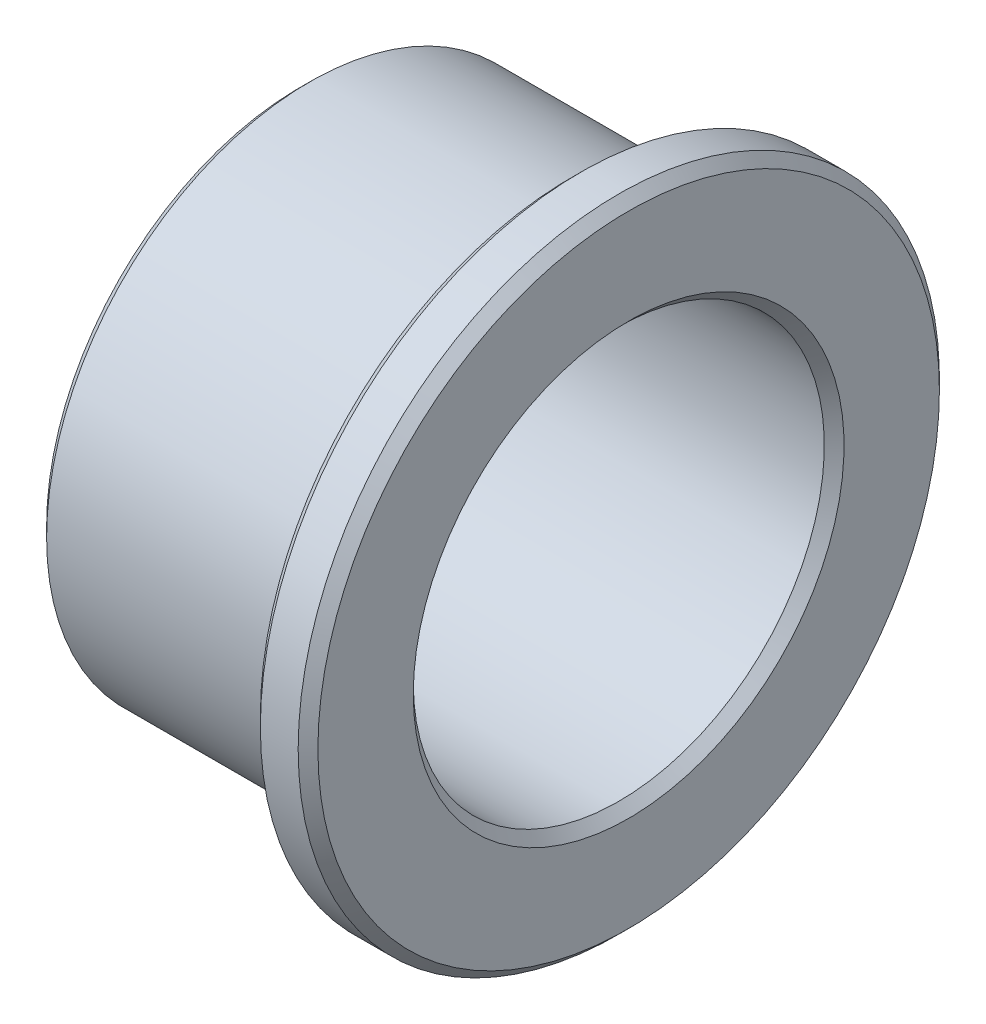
ISO-10303-21;
HEADER;
FILE_DESCRIPTION(('STEP AP214'),'2;1');
FILE_NAME('part.step','',(''),(''),'','','');
FILE_SCHEMA(('AUTOMOTIVE_DESIGN { 1 0 10303 214 1 1 1 1 }'));
ENDSEC;
DATA;
#1=APPLICATION_CONTEXT('core data for automotive mechanical design processes');
#2=APPLICATION_PROTOCOL_DEFINITION('international standard','automotive_design',2000,#1);
#3=PRODUCT_CONTEXT('',#1,'mechanical');
#4=PRODUCT('Part','Part','',(#3));
#5=PRODUCT_RELATED_PRODUCT_CATEGORY('part','',(#4));
#6=PRODUCT_DEFINITION_FORMATION('','',#4);
#7=PRODUCT_DEFINITION_CONTEXT('part definition',#1,'design');
#8=PRODUCT_DEFINITION('design','',#6,#7);
#9=PRODUCT_DEFINITION_SHAPE('','',#8);
#10=(LENGTH_UNIT() NAMED_UNIT(*) SI_UNIT(.MILLI.,.METRE.));
#11=(NAMED_UNIT(*) PLANE_ANGLE_UNIT() SI_UNIT($,.RADIAN.));
#12=(NAMED_UNIT(*) SI_UNIT($,.STERADIAN.) SOLID_ANGLE_UNIT());
#13=UNCERTAINTY_MEASURE_WITH_UNIT(LENGTH_MEASURE(1.E-05),#10,'distance_accuracy_value','');
#14=(GEOMETRIC_REPRESENTATION_CONTEXT(3) GLOBAL_UNCERTAINTY_ASSIGNED_CONTEXT((#13)) GLOBAL_UNIT_ASSIGNED_CONTEXT((#10,
#11,#12)) REPRESENTATION_CONTEXT('',''));
#15=CARTESIAN_POINT('',(0.,0.,0.));
#16=DIRECTION('',(0.,0.,1.));
#17=DIRECTION('',(1.,0.,0.));
#18=AXIS2_PLACEMENT_3D('',#15,#16,#17);
#19=CARTESIAN_POINT('',(0.,0.,0.));
#20=DIRECTION('',(-1.,0.,0.));
#21=DIRECTION('',(0.,0.,1.));
#22=AXIS2_PLACEMENT_3D('',#19,#20,#21);
#23=CONICAL_SURFACE('',#22,13.1,0.785398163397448);
#24=CARTESIAN_POINT('',(0.600000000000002,0.,0.));
#25=DIRECTION('',(-1.,0.,0.));
#26=DIRECTION('',(0.,0.,1.));
#27=AXIS2_PLACEMENT_3D('',#24,#25,#26);
#28=CIRCLE('',#27,12.5);
#29=CARTESIAN_POINT('',(0.600000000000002,0.,12.5));
#30=VERTEX_POINT('',#29);
#31=EDGE_CURVE('E70',#30,#30,#28,.T.);
#32=ORIENTED_EDGE('',*,*,#31,.F.);
#33=EDGE_LOOP('',(#32));
#34=FACE_BOUND('',#33,.T.);
#35=CARTESIAN_POINT('',(0.,0.,0.));
#36=DIRECTION('',(-1.,0.,0.));
#37=DIRECTION('',(0.,0.,1.));
#38=AXIS2_PLACEMENT_3D('',#35,#36,#37);
#39=CIRCLE('',#38,13.1);
#40=CARTESIAN_POINT('',(0.,0.,13.1));
#41=VERTEX_POINT('',#40);
#42=EDGE_CURVE('E10',#41,#41,#39,.T.);
#43=ORIENTED_EDGE('',*,*,#42,.T.);
#44=EDGE_LOOP('',(#43));
#45=FACE_BOUND('',#44,.T.);
#46=ADVANCED_FACE('F30',(#34,#45),#23,.F.);
#47=CARTESIAN_POINT('',(0.,13.1,0.));
#48=DIRECTION('',(1.,0.,0.));
#49=DIRECTION('',(0.,0.,-1.));
#50=AXIS2_PLACEMENT_3D('',#47,#48,#49);
#51=PLANE('',#50);
#52=ORIENTED_EDGE('',*,*,#42,.F.);
#53=EDGE_LOOP('',(#52));
#54=FACE_BOUND('',#53,.T.);
#55=CARTESIAN_POINT('',(0.,0.,0.));
#56=DIRECTION('',(-1.,0.,0.));
#57=DIRECTION('',(0.,0.,1.));
#58=AXIS2_PLACEMENT_3D('',#55,#56,#57);
#59=CIRCLE('',#58,15.4);
#60=CARTESIAN_POINT('',(0.,0.,15.4));
#61=VERTEX_POINT('',#60);
#62=EDGE_CURVE('E36',#61,#61,#59,.T.);
#63=ORIENTED_EDGE('',*,*,#62,.T.);
#64=EDGE_LOOP('',(#63));
#65=FACE_BOUND('',#64,.T.);
#66=ADVANCED_FACE('F77',(#54,#65),#51,.F.);
#67=CARTESIAN_POINT('',(0.600000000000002,0.,0.));
#68=DIRECTION('',(1.,0.,0.));
#69=DIRECTION('',(0.,0.,-1.));
#70=AXIS2_PLACEMENT_3D('',#67,#68,#69);
#71=CONICAL_SURFACE('',#70,16.,0.785398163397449);
#72=ORIENTED_EDGE('',*,*,#62,.F.);
#73=EDGE_LOOP('',(#72));
#74=FACE_BOUND('',#73,.T.);
#75=CARTESIAN_POINT('',(0.600000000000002,0.,0.));
#76=DIRECTION('',(-1.,0.,0.));
#77=DIRECTION('',(0.,0.,1.));
#78=AXIS2_PLACEMENT_3D('',#75,#76,#77);
#79=CIRCLE('',#78,16.);
#80=CARTESIAN_POINT('',(0.600000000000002,0.,16.));
#81=VERTEX_POINT('',#80);
#82=EDGE_CURVE('E40',#81,#81,#79,.T.);
#83=ORIENTED_EDGE('',*,*,#82,.T.);
#84=EDGE_LOOP('',(#83));
#85=FACE_BOUND('',#84,.T.);
#86=ADVANCED_FACE('F81',(#74,#85),#71,.T.);
#87=CARTESIAN_POINT('',(0.,0.,0.));
#88=DIRECTION('',(-1.,0.,0.));
#89=DIRECTION('',(0.,0.,1.));
#90=AXIS2_PLACEMENT_3D('',#87,#88,#89);
#91=CYLINDRICAL_SURFACE('',#90,16.);
#92=ORIENTED_EDGE('',*,*,#82,.F.);
#93=EDGE_LOOP('',(#92));
#94=FACE_BOUND('',#93,.T.);
#95=CARTESIAN_POINT('',(15.9,0.,0.));
#96=DIRECTION('',(-1.,0.,0.));
#97=DIRECTION('',(0.,0.,1.));
#98=AXIS2_PLACEMENT_3D('',#95,#96,#97);
#99=CIRCLE('',#98,16.);
#100=CARTESIAN_POINT('',(15.9,0.,16.));
#101=VERTEX_POINT('',#100);
#102=EDGE_CURVE('E44',#101,#101,#99,.T.);
#103=ORIENTED_EDGE('',*,*,#102,.T.);
#104=EDGE_LOOP('',(#103));
#105=FACE_BOUND('',#104,.T.);
#106=ADVANCED_FACE('F86',(#94,#105),#91,.T.);
#107=CARTESIAN_POINT('',(15.9,0.,0.));
#108=DIRECTION('',(-1.,0.,0.));
#109=DIRECTION('',(0.,0.,1.));
#110=AXIS2_PLACEMENT_3D('',#107,#108,#109);
#111=TOROIDAL_SURFACE('',#110,16.6,0.600000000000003);
#112=ORIENTED_EDGE('',*,*,#102,.F.);
#113=EDGE_LOOP('',(#112));
#114=FACE_BOUND('',#113,.T.);
#115=CARTESIAN_POINT('',(16.5,0.,0.));
#116=DIRECTION('',(-1.,0.,0.));
#117=DIRECTION('',(0.,0.,1.));
#118=AXIS2_PLACEMENT_3D('',#115,#116,#117);
#119=CIRCLE('',#118,16.6);
#120=CARTESIAN_POINT('',(16.5,0.,16.6));
#121=VERTEX_POINT('',#120);
#122=EDGE_CURVE('E49',#121,#121,#119,.T.);
#123=ORIENTED_EDGE('',*,*,#122,.T.);
#124=EDGE_LOOP('',(#123));
#125=FACE_BOUND('',#124,.T.);
#126=ADVANCED_FACE('F92',(#114,#125),#111,.F.);
#127=CARTESIAN_POINT('',(16.5,16.6,0.));
#128=DIRECTION('',(1.,0.,0.));
#129=DIRECTION('',(0.,0.,-1.));
#130=AXIS2_PLACEMENT_3D('',#127,#128,#129);
#131=PLANE('',#130);
#132=ORIENTED_EDGE('',*,*,#122,.F.);
#133=EDGE_LOOP('',(#132));
#134=FACE_BOUND('',#133,.T.);
#135=CARTESIAN_POINT('',(16.5,0.,0.));
#136=DIRECTION('',(-1.,0.,0.));
#137=DIRECTION('',(0.,0.,1.));
#138=AXIS2_PLACEMENT_3D('',#135,#136,#137);
#139=CIRCLE('',#138,18.9);
#140=CARTESIAN_POINT('',(16.5,0.,18.9));
#141=VERTEX_POINT('',#140);
#142=EDGE_CURVE('E52',#141,#141,#139,.T.);
#143=ORIENTED_EDGE('',*,*,#142,.T.);
#144=EDGE_LOOP('',(#143));
#145=FACE_BOUND('',#144,.T.);
#146=ADVANCED_FACE('F96',(#134,#145),#131,.F.);
#147=CARTESIAN_POINT('',(17.1,0.,0.));
#148=DIRECTION('',(1.,0.,0.));
#149=DIRECTION('',(0.,0.,-1.));
#150=AXIS2_PLACEMENT_3D('',#147,#148,#149);
#151=CONICAL_SURFACE('',#150,19.5,0.785398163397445);
#152=ORIENTED_EDGE('',*,*,#142,.F.);
#153=EDGE_LOOP('',(#152));
#154=FACE_BOUND('',#153,.T.);
#155=CARTESIAN_POINT('',(17.1,0.,0.));
#156=DIRECTION('',(-1.,0.,0.));
#157=DIRECTION('',(0.,0.,1.));
#158=AXIS2_PLACEMENT_3D('',#155,#156,#157);
#159=CIRCLE('',#158,19.5);
#160=CARTESIAN_POINT('',(17.1,0.,19.5));
#161=VERTEX_POINT('',#160);
#162=EDGE_CURVE('E55',#161,#161,#159,.T.);
#163=ORIENTED_EDGE('',*,*,#162,.T.);
#164=EDGE_LOOP('',(#163));
#165=FACE_BOUND('',#164,.T.);
#166=ADVANCED_FACE('F100',(#154,#165),#151,.T.);
#167=CARTESIAN_POINT('',(0.,0.,0.));
#168=DIRECTION('',(-1.,0.,0.));
#169=DIRECTION('',(0.,0.,1.));
#170=AXIS2_PLACEMENT_3D('',#167,#168,#169);
#171=CYLINDRICAL_SURFACE('',#170,19.5);
#172=ORIENTED_EDGE('',*,*,#162,.F.);
#173=EDGE_LOOP('',(#172));
#174=FACE_BOUND('',#173,.T.);
#175=CARTESIAN_POINT('',(19.4,0.,0.));
#176=DIRECTION('',(-1.,0.,0.));
#177=DIRECTION('',(0.,0.,1.));
#178=AXIS2_PLACEMENT_3D('',#175,#176,#177);
#179=CIRCLE('',#178,19.5);
#180=CARTESIAN_POINT('',(19.4,0.,19.5));
#181=VERTEX_POINT('',#180);
#182=EDGE_CURVE('E58',#181,#181,#179,.T.);
#183=ORIENTED_EDGE('',*,*,#182,.T.);
#184=EDGE_LOOP('',(#183));
#185=FACE_BOUND('',#184,.T.);
#186=ADVANCED_FACE('F104',(#174,#185),#171,.T.);
#187=CARTESIAN_POINT('',(20.,0.,0.));
#188=DIRECTION('',(-1.,0.,0.));
#189=DIRECTION('',(0.,0.,1.));
#190=AXIS2_PLACEMENT_3D('',#187,#188,#189);
#191=CONICAL_SURFACE('',#190,18.9,0.785398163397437);
#192=ORIENTED_EDGE('',*,*,#182,.F.);
#193=EDGE_LOOP('',(#192));
#194=FACE_BOUND('',#193,.T.);
#195=CARTESIAN_POINT('',(20.,0.,0.));
#196=DIRECTION('',(-1.,0.,0.));
#197=DIRECTION('',(0.,0.,1.));
#198=AXIS2_PLACEMENT_3D('',#195,#196,#197);
#199=CIRCLE('',#198,18.9);
#200=CARTESIAN_POINT('',(20.,0.,18.9));
#201=VERTEX_POINT('',#200);
#202=EDGE_CURVE('E61',#201,#201,#199,.T.);
#203=ORIENTED_EDGE('',*,*,#202,.T.);
#204=EDGE_LOOP('',(#203));
#205=FACE_BOUND('',#204,.T.);
#206=ADVANCED_FACE('F108',(#194,#205),#191,.T.);
#207=CARTESIAN_POINT('',(20.,18.9,0.));
#208=DIRECTION('',(-1.,0.,0.));
#209=DIRECTION('',(0.,0.,1.));
#210=AXIS2_PLACEMENT_3D('',#207,#208,#209);
#211=PLANE('',#210);
#212=ORIENTED_EDGE('',*,*,#202,.F.);
#213=EDGE_LOOP('',(#212));
#214=FACE_BOUND('',#213,.T.);
#215=CARTESIAN_POINT('',(20.,0.,0.));
#216=DIRECTION('',(-1.,0.,0.));
#217=DIRECTION('',(0.,0.,1.));
#218=AXIS2_PLACEMENT_3D('',#215,#216,#217);
#219=CIRCLE('',#218,13.1);
#220=CARTESIAN_POINT('',(20.,0.,13.1));
#221=VERTEX_POINT('',#220);
#222=EDGE_CURVE('E64',#221,#221,#219,.T.);
#223=ORIENTED_EDGE('',*,*,#222,.T.);
#224=EDGE_LOOP('',(#223));
#225=FACE_BOUND('',#224,.T.);
#226=ADVANCED_FACE('F112',(#214,#225),#211,.F.);
#227=CARTESIAN_POINT('',(19.4,0.,0.));
#228=DIRECTION('',(1.,0.,0.));
#229=DIRECTION('',(0.,0.,-1.));
#230=AXIS2_PLACEMENT_3D('',#227,#228,#229);
#231=CONICAL_SURFACE('',#230,12.5,0.78539816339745);
#232=ORIENTED_EDGE('',*,*,#222,.F.);
#233=EDGE_LOOP('',(#232));
#234=FACE_BOUND('',#233,.T.);
#235=CARTESIAN_POINT('',(19.4,0.,0.));
#236=DIRECTION('',(-1.,0.,0.));
#237=DIRECTION('',(0.,0.,1.));
#238=AXIS2_PLACEMENT_3D('',#235,#236,#237);
#239=CIRCLE('',#238,12.5);
#240=CARTESIAN_POINT('',(19.4,0.,12.5));
#241=VERTEX_POINT('',#240);
#242=EDGE_CURVE('E67',#241,#241,#239,.T.);
#243=ORIENTED_EDGE('',*,*,#242,.T.);
#244=EDGE_LOOP('',(#243));
#245=FACE_BOUND('',#244,.T.);
#246=ADVANCED_FACE('F116',(#234,#245),#231,.F.);
#247=CARTESIAN_POINT('',(0.,0.,0.));
#248=DIRECTION('',(-1.,0.,0.));
#249=DIRECTION('',(0.,0.,1.));
#250=AXIS2_PLACEMENT_3D('',#247,#248,#249);
#251=CYLINDRICAL_SURFACE('',#250,12.5);
#252=ORIENTED_EDGE('',*,*,#242,.F.);
#253=EDGE_LOOP('',(#252));
#254=FACE_BOUND('',#253,.T.);
#255=ORIENTED_EDGE('',*,*,#31,.T.);
#256=EDGE_LOOP('',(#255));
#257=FACE_BOUND('',#256,.T.);
#258=ADVANCED_FACE('F74',(#254,#257),#251,.F.);
#259=CLOSED_SHELL('',(#46,#66,#86,#106,#126,#146,#166,#186,#206,#226,#246,#258));
#260=MANIFOLD_SOLID_BREP('B2',#259);
#261=ADVANCED_BREP_SHAPE_REPRESENTATION('',(#18,#260),#14);
#262=SHAPE_DEFINITION_REPRESENTATION(#9,#261);
ENDSEC;
END-ISO-10303-21;
